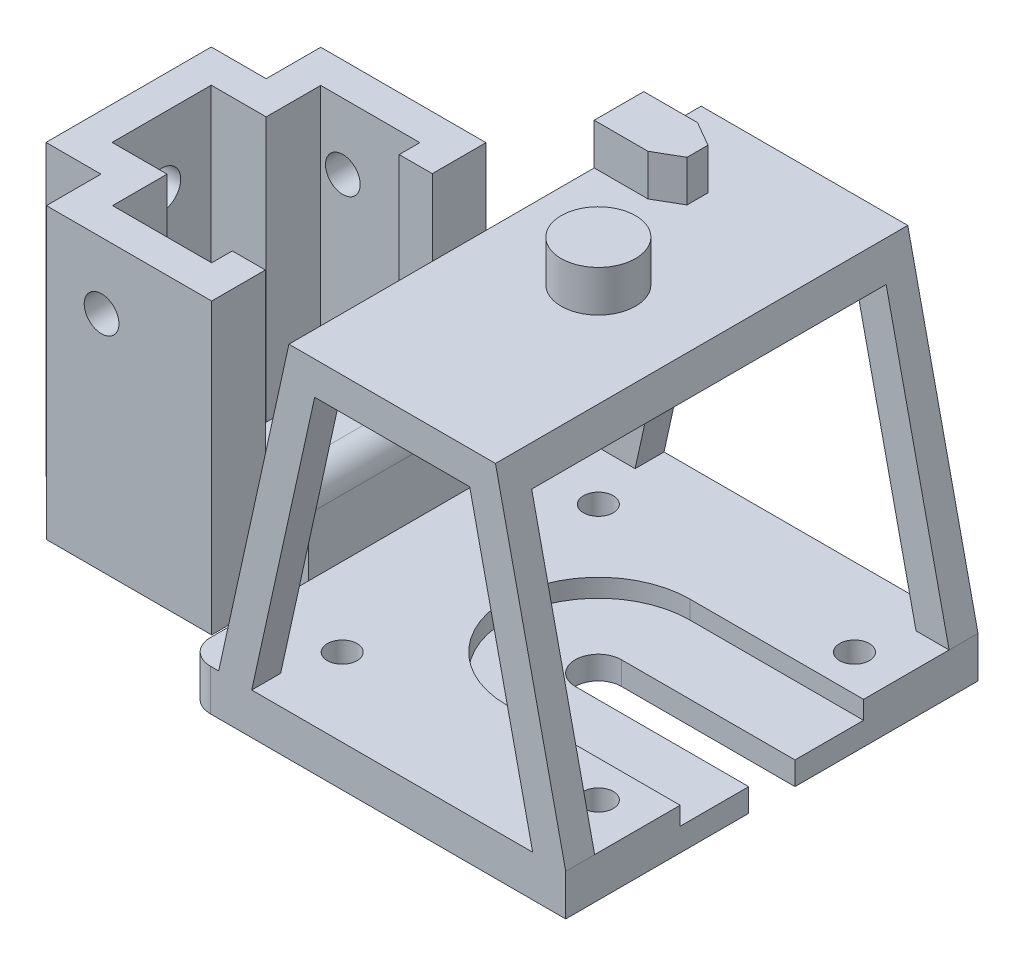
from build123d import *

# Parameters (mm, degrees)
BOSS_EXTRUDE1_DEPTH = 5
SKETCH2_R           = 1.8
CUT_EXTRUDE1_DEPTH  = 15
CUT_EXTRUDE2_DEPTH  = 2.2
BOSS_EXTRUDE2_DEPTH = 3.5
BOSS_EXTRUDE3_REACH = 102.528
SKETCH7_R           = 4.5
BOSS_EXTRUDE4_DEPTH = 5
BOSS_EXTRUDE6_DEPTH = 30
CUT_EXTRUDE4_DEPTH  = 49
BOSS_EXTRUDE7_DEPTH = 5
FILLET3_R           = 3
SKETCH14_R          = 2.1
CUT_EXTRUDE5_DEPTH  = 46
SKETCH15_R          = 2.3
CUT_EXTRUDE6_DEPTH  = 13
SKETCH16_W          = 9.2
SKETCH16_H          = 20.2
BOSS_EXTRUDE8_DEPTH = 10
FILLET4_R           = 3


with BuildPart() as part:
    # Sketch1 → Boss-Extrude1 (new body)
    with BuildSketch(Plane(origin=(0, 0, 0), x_dir=(1, 0, 0), z_dir=(0, 1, 0))):
        Polygon((0, -10), (0, 10), (6.65, 10), (6.65, 16.6), (26.65, 16.6), (26.65, 10.1), (31.85, 10.1), (31.85, 24.95), (56.85, 24.95), (77.85, 24.95), (77.85, -24.95), (56.85, -24.95), (31.85, -24.95), (31.85, -10.1), (26.65, -10.1), (26.65, -16.6), (6.65, -16.6), (6.65, -10), align=None)
    extrude(amount=BOSS_EXTRUDE1_DEPTH)

    # Sketch2 → Cut-Extrude1 (cut)
    with BuildSketch(Plane(origin=(0, 5, 0), x_dir=(1, 0, 0), z_dir=(0, 1, 0))):
        with Locations(Location((41.35, 15.5, 0), (0, 0, 270))):
            Circle(SKETCH2_R)
        with Locations(Location((72.35, 15.5, 0), (0, 0, 270))):
            Circle(SKETCH2_R)
        with Locations(Location((72.35, -15.5, 0), (0, 0, 270))):
            Circle(SKETCH2_R)
        with Locations(Location((41.35, -15.5, 0), (0, 0, 270))):
            Circle(SKETCH2_R)
        with BuildLine():
            Line((56.85, 2.8), (77.85, 2.8))
            Line((77.85, 2.8), (77.85, -2.8))
            Line((77.85, -2.8), (56.85, -2.8))
            ThreePointArc((56.85, -2.8), (54.05, 0), (56.85, 2.8))
        make_face()
    extrude(amount=-CUT_EXTRUDE1_DEPTH, mode=Mode.SUBTRACT)

    # Sketch3 → Cut-Extrude2 (cut)
    with BuildSketch(Plane(origin=(0, 5, 0), x_dir=(1, 0, 0), z_dir=(0, 1, 0))):
        with BuildLine():
            Line((56.85, 11.1), (77.85, 11.1))
            Line((77.85, 11.1), (77.85, -11.1))
            Line((77.85, -11.1), (56.85, -11.1))
            ThreePointArc((56.85, -11.1), (45.75, 0), (56.85, 11.1))
        make_face()
    extrude(amount=-CUT_EXTRUDE2_DEPTH, mode=Mode.SUBTRACT)

    # Sketch5 → Boss-Extrude2 (add)
    with BuildSketch(Plane.XY.offset(24.95)):
        Polygon((35.85, 5), (44.35, 43.5), (69.35, 43.5), (77.85, 5), (73.85, 5), (66.233116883, 39.5), (47.466883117, 39.5), (39.85, 5), align=None)
    boss_extrude2 = extrude(amount=-BOSS_EXTRUDE2_DEPTH)

    # Mirror1: Boss-Extrude2 across plane
    add(boss_extrude2.mirror(Plane.XY))

    # Sketch6 → Boss-Extrude3 (add, up to next)
    with BuildSketch(Plane(origin=(0, 0, 21.45), x_dir=(-1, 0, 0), z_dir=(0, 0, -1)), mode=Mode.PRIVATE) as boss_extrude3_sk1:
        Polygon((-69.35, 43.5), (-44.35, 43.5), (-43.466883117, 39.5), (-70.233116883, 39.5), align=None)
    boss_extrude3_tool1 = extrude(boss_extrude3_sk1.sketch, amount=BOSS_EXTRUDE3_REACH, mode=Mode.PRIVATE) - part.part
    add(boss_extrude3_tool1.solids().sort_by_distance((56.85, 41.477254, 21.45))[0])

    # Sketch7 → Boss-Extrude4 (add)
    with BuildSketch(Plane(origin=(0, 43.5, 0), x_dir=(1, 0, 0), z_dir=(0, 1, 0))):
        with Locations(Location((56.85, 0, 0), (0, 0, 270))):
            Circle(SKETCH7_R)
    extrude(amount=BOSS_EXTRUDE4_DEPTH)

    # Sketch10 → Boss-Extrude6 (add)
    with BuildSketch(Plane(origin=(0, 5, 0), x_dir=(1, 0, 0), z_dir=(0, 1, 0))):
        Polygon((6.65, -10), (6.65, -16.6), (26.65, -16.6), (26.65, -10.1), (22.65, -10.1), (22.65, -12.6), (10.65, -12.6), (10.65, -6), (4, -6), (4, 6), (10.65, 6), (10.65, 12.6), (22.65, 12.6), (22.65, 10.1), (26.65, 10.1), (26.65, 16.6), (6.65, 16.6), (6.65, 10), (0, 10), (0, -10), align=None)
    extrude(amount=BOSS_EXTRUDE6_DEPTH)

    # Sketch12 → Cut-Extrude4 (cut)
    with BuildSketch(Plane(origin=(0, 5, 0), x_dir=(1, 0, 0), z_dir=(0, 1, 0))):
        Polygon((22.65, -10.1), (22.65, -12.6), (10.65, -12.6), (10.65, -6), (4, -6), (4, 6), (10.65, 6), (10.65, 12.6), (22.65, 12.6), (22.65, 10.1), align=None)
    extrude(amount=-CUT_EXTRUDE4_DEPTH, mode=Mode.SUBTRACT)

    # Sketch13 → Boss-Extrude7 (add)
    with BuildSketch(Plane(origin=(0, 43.5, 0), x_dir=(1, 0, 0), z_dir=(0, 1, 0))):
        Polygon((53.85, 16.267949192), (50.85, 18), (44.35, 18), (44.35, 12), (50.85, 12), (53.85, 13.732050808), align=None)
    extrude(amount=BOSS_EXTRUDE7_DEPTH)

    # Fillet3
    fillet3_edges = [part.edges().sort_by_distance(p)[0] for p in [
        (31.85, 2.5, 24.95),
        (31.85, 2.5, -24.95),
    ]]
    fillet(fillet3_edges, radius=FILLET3_R)

    # Sketch14 → Cut-Extrude5 (cut)
    with BuildSketch(Plane.XY.offset(16.6)):
        with Locations(Location((13.325, 27, 0), (0, 0, 180))):
            Circle(SKETCH14_R)
    extrude(amount=-CUT_EXTRUDE5_DEPTH, mode=Mode.SUBTRACT)

    # Sketch15 → Cut-Extrude6 (cut)
    with BuildSketch(Plane.ZY):
        with Locations((0, 27)):
            Circle(SKETCH15_R)
    extrude(amount=-CUT_EXTRUDE6_DEPTH, mode=Mode.SUBTRACT)

    # Sketch16 → Boss-Extrude8 (add)
    with BuildSketch(Plane(origin=(0, 5, 0), x_dir=(1, 0, 0), z_dir=(0, 1, 0))):
        with Locations((27.25, 0)):
            Rectangle(SKETCH16_W, SKETCH16_H)
    extrude(amount=BOSS_EXTRUDE8_DEPTH)

    # Fillet4
    fillet4_edges = [part.edges().sort_by_distance(p)[0] for p in [
        (31.85, 15, 0),
    ]]
    fillet(fillet4_edges, radius=FILLET4_R)


solid = part.part
